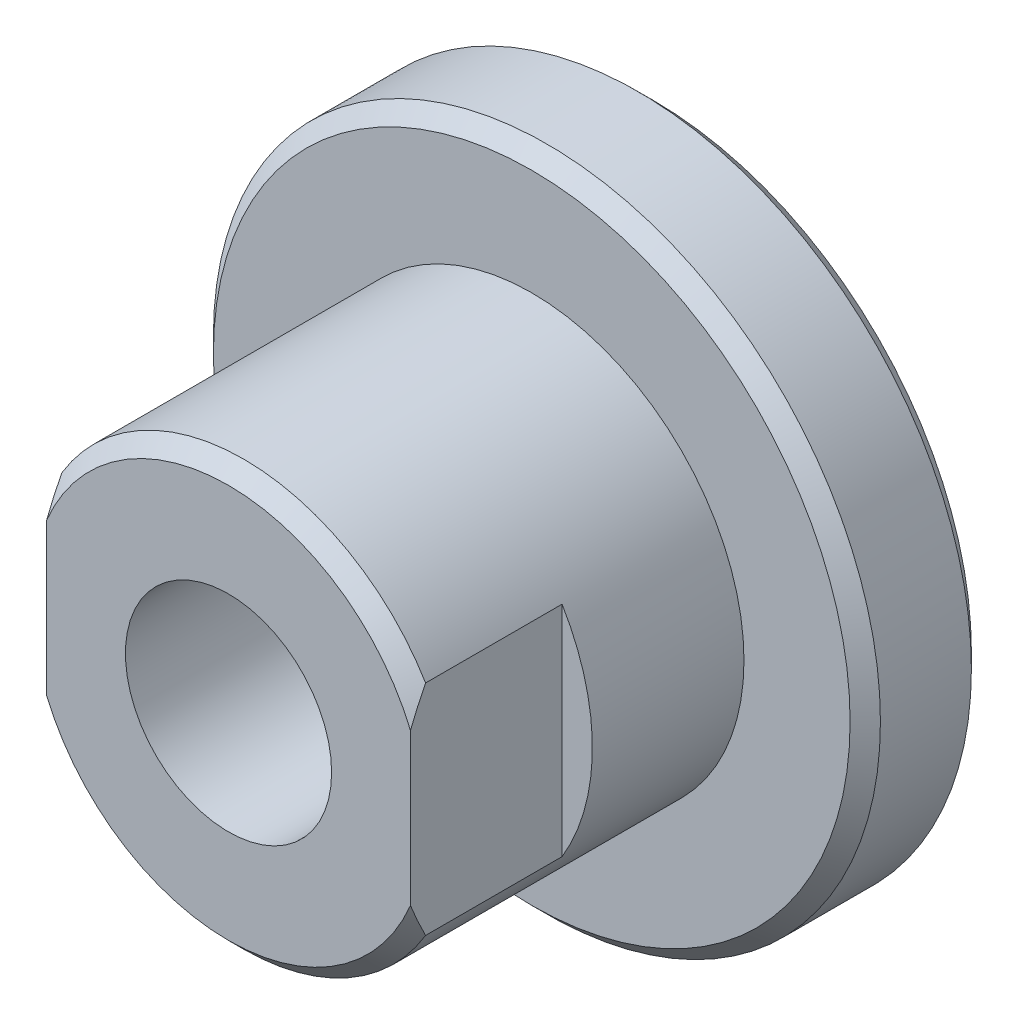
from build123d import *

# Parameters (mm, degrees)
ESQUISSE1_R             = 11
EXTRUSION1_DEPTH        = 4
ESQUISSE2_R             = 7
EXTRUSION2_DEPTH        = 10
CHANFREIN2_SIZE         = 0.5
ESQUISSE3_W             = 8.70842535
ESQUISSE3_H             = 21.848357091
ESQUISSE3_W_2           = 7.471725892
ESQUISSE3_H_2           = 24.424814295
ENL_V_MAT_EXTRU_1_DEPTH = 5
TROU_TARAUD_M81_D       = 6.8


with BuildPart() as part:
    # Esquisse1 → Extrusion1 (new body)
    with BuildSketch(Plane.XY):
        Circle(ESQUISSE1_R)
    extrude(amount=EXTRUSION1_DEPTH)

    # Esquisse2 → Extrusion2 (add)
    with BuildSketch(Plane.XY.offset(4)):
        Circle(ESQUISSE2_R)
    extrude(amount=EXTRUSION2_DEPTH)

    # Chanfrein2
    chanfrein2_edges = [part.edges().sort_by_distance(p)[0] for p in [
        (-11, 0, 0),
        (-11, 0, 4),
        (-7, 0, 14),
    ]]
    chamfer(chanfrein2_edges, length=CHANFREIN2_SIZE)

    # Esquisse3 → Enl_v. mat.-Extru.1 (cut)
    with BuildSketch(Plane.XY.offset(14)):
        with Locations((10.354212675, 0.309174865)):
            Rectangle(ESQUISSE3_W, ESQUISSE3_H)
        with Locations((-9.735862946, 1.597403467)):
            Rectangle(ESQUISSE3_W_2, ESQUISSE3_H_2)
    extrude(amount=-ENL_V_MAT_EXTRU_1_DEPTH, mode=Mode.SUBTRACT)

    # Trou taraud_ M81 (through all)
    with Locations(Plane.XY.offset(14)):
        with Locations((0, 0)):
            Hole(TROU_TARAUD_M81_D / 2)


solid = part.part
